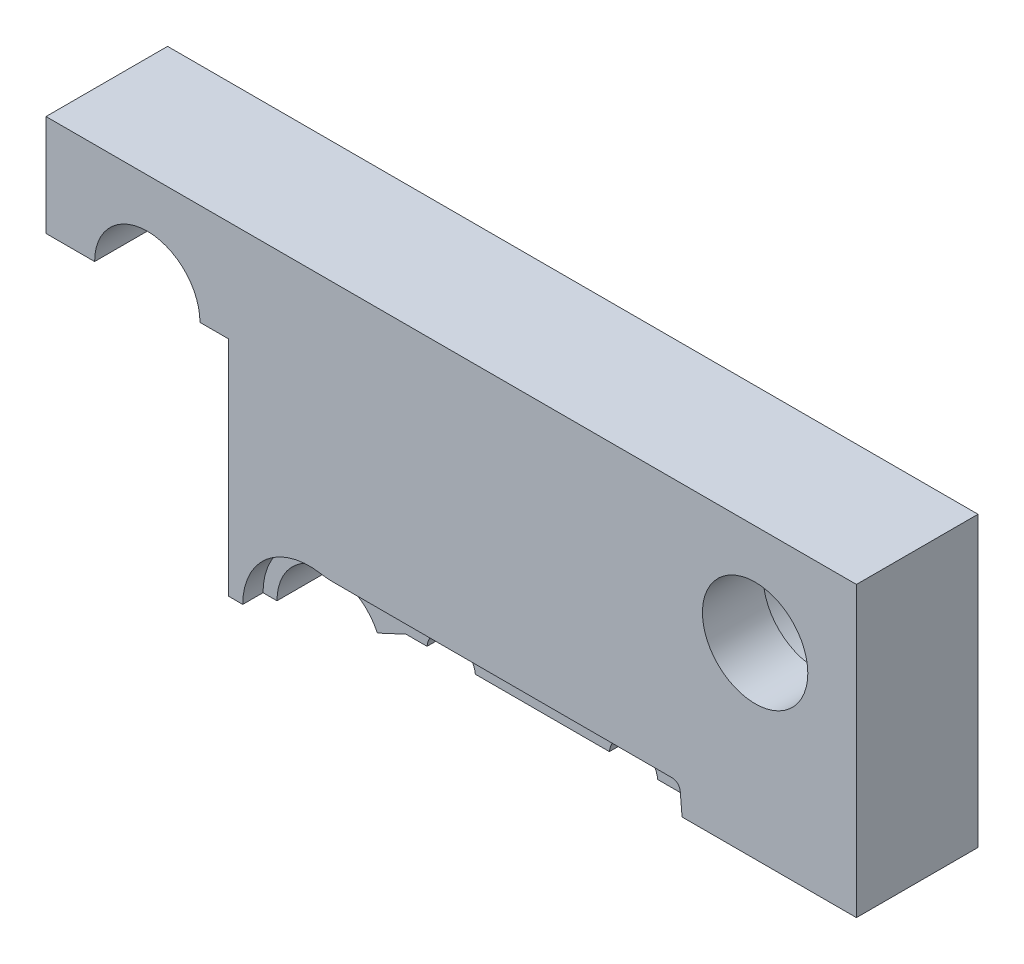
ISO-10303-21;
HEADER;
FILE_DESCRIPTION(('STEP AP214'),'2;1');
FILE_NAME('part.step','',(''),(''),'','','');
FILE_SCHEMA(('AUTOMOTIVE_DESIGN { 1 0 10303 214 1 1 1 1 }'));
ENDSEC;
DATA;
#1=APPLICATION_CONTEXT('core data for automotive mechanical design processes');
#2=APPLICATION_PROTOCOL_DEFINITION('international standard','automotive_design',2000,#1);
#3=PRODUCT_CONTEXT('',#1,'mechanical');
#4=PRODUCT('Part','Part','',(#3));
#5=PRODUCT_RELATED_PRODUCT_CATEGORY('part','',(#4));
#6=PRODUCT_DEFINITION_FORMATION('','',#4);
#7=PRODUCT_DEFINITION_CONTEXT('part definition',#1,'design');
#8=PRODUCT_DEFINITION('design','',#6,#7);
#9=PRODUCT_DEFINITION_SHAPE('','',#8);
#10=(LENGTH_UNIT() NAMED_UNIT(*) SI_UNIT(.MILLI.,.METRE.));
#11=(NAMED_UNIT(*) PLANE_ANGLE_UNIT() SI_UNIT($,.RADIAN.));
#12=(NAMED_UNIT(*) SI_UNIT($,.STERADIAN.) SOLID_ANGLE_UNIT());
#13=UNCERTAINTY_MEASURE_WITH_UNIT(LENGTH_MEASURE(1.E-05),#10,'distance_accuracy_value','');
#14=(GEOMETRIC_REPRESENTATION_CONTEXT(3) GLOBAL_UNCERTAINTY_ASSIGNED_CONTEXT((#13)) GLOBAL_UNIT_ASSIGNED_CONTEXT((#10,
#11,#12)) REPRESENTATION_CONTEXT('',''));
#15=CARTESIAN_POINT('',(0.,0.,0.));
#16=DIRECTION('',(0.,0.,1.));
#17=DIRECTION('',(1.,0.,0.));
#18=AXIS2_PLACEMENT_3D('',#15,#16,#17);
#19=CARTESIAN_POINT('',(0.,0.,30.));
#20=DIRECTION('',(1.,0.,0.));
#21=DIRECTION('',(0.,0.,-1.));
#22=AXIS2_PLACEMENT_3D('',#19,#20,#21);
#23=PLANE('',#22);
#24=DIRECTION('',(0.,-1.,0.));
#25=VECTOR('',#24,1.);
#26=CARTESIAN_POINT('',(0.,0.,0.));
#27=LINE('',#26,#25);
#28=CARTESIAN_POINT('',(0.,150.,0.));
#29=VERTEX_POINT('',#28);
#30=CARTESIAN_POINT('',(0.,125.,0.));
#31=VERTEX_POINT('',#30);
#32=EDGE_CURVE('E298',#29,#31,#27,.T.);
#33=ORIENTED_EDGE('',*,*,#32,.T.);
#34=DIRECTION('',(0.,0.,1.));
#35=VECTOR('',#34,1.);
#36=CARTESIAN_POINT('',(0.,125.,30.));
#37=LINE('',#36,#35);
#38=CARTESIAN_POINT('',(0.,125.,30.));
#39=VERTEX_POINT('',#38);
#40=EDGE_CURVE('E334',#31,#39,#37,.T.);
#41=ORIENTED_EDGE('',*,*,#40,.T.);
#42=DIRECTION('',(0.,-1.,0.));
#43=VECTOR('',#42,1.);
#44=CARTESIAN_POINT('',(0.,0.,30.));
#45=LINE('',#44,#43);
#46=CARTESIAN_POINT('',(0.,150.,30.));
#47=VERTEX_POINT('',#46);
#48=EDGE_CURVE('E312',#47,#39,#45,.T.);
#49=ORIENTED_EDGE('',*,*,#48,.F.);
#50=DIRECTION('',(0.,0.,-1.));
#51=VECTOR('',#50,1.);
#52=CARTESIAN_POINT('',(0.,150.,30.));
#53=LINE('',#52,#51);
#54=EDGE_CURVE('E234',#47,#29,#53,.T.);
#55=ORIENTED_EDGE('',*,*,#54,.T.);
#56=EDGE_LOOP('',(#33,#41,#49,#55));
#57=FACE_BOUND('',#56,.T.);
#58=ADVANCED_FACE('F28',(#57),#23,.F.);
#59=CARTESIAN_POINT('',(200.,0.,30.));
#60=DIRECTION('',(-1.,0.,0.));
#61=DIRECTION('',(0.,0.,1.));
#62=AXIS2_PLACEMENT_3D('',#59,#60,#61);
#63=PLANE('',#62);
#64=DIRECTION('',(0.,1.,0.));
#65=VECTOR('',#64,1.);
#66=CARTESIAN_POINT('',(200.,0.,30.));
#67=LINE('',#66,#65);
#68=CARTESIAN_POINT('',(200.,78.7816772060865,30.));
#69=VERTEX_POINT('',#68);
#70=CARTESIAN_POINT('',(200.,150.,30.));
#71=VERTEX_POINT('',#70);
#72=EDGE_CURVE('E315',#69,#71,#67,.T.);
#73=ORIENTED_EDGE('',*,*,#72,.F.);
#74=DIRECTION('',(0.,0.,-1.));
#75=VECTOR('',#74,1.);
#76=CARTESIAN_POINT('',(200.,78.7816772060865,30.));
#77=LINE('',#76,#75);
#78=CARTESIAN_POINT('',(200.,78.7816772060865,0.));
#79=VERTEX_POINT('',#78);
#80=EDGE_CURVE('E386',#69,#79,#77,.T.);
#81=ORIENTED_EDGE('',*,*,#80,.T.);
#82=DIRECTION('',(0.,1.,0.));
#83=VECTOR('',#82,1.);
#84=CARTESIAN_POINT('',(200.,0.,0.));
#85=LINE('',#84,#83);
#86=CARTESIAN_POINT('',(200.,150.,0.));
#87=VERTEX_POINT('',#86);
#88=EDGE_CURVE('E308',#79,#87,#85,.T.);
#89=ORIENTED_EDGE('',*,*,#88,.T.);
#90=DIRECTION('',(0.,0.,-1.));
#91=VECTOR('',#90,1.);
#92=CARTESIAN_POINT('',(200.,150.,30.));
#93=LINE('',#92,#91);
#94=EDGE_CURVE('E229',#71,#87,#93,.T.);
#95=ORIENTED_EDGE('',*,*,#94,.F.);
#96=EDGE_LOOP('',(#73,#81,#89,#95));
#97=FACE_BOUND('',#96,.T.);
#98=ADVANCED_FACE('F499',(#97),#63,.F.);
#99=CARTESIAN_POINT('',(0.,150.,30.));
#100=DIRECTION('',(0.,-1.,0.));
#101=DIRECTION('',(0.,0.,-1.));
#102=AXIS2_PLACEMENT_3D('',#99,#100,#101);
#103=PLANE('',#102);
#104=DIRECTION('',(-1.,0.,0.));
#105=VECTOR('',#104,1.);
#106=CARTESIAN_POINT('',(0.,150.,0.));
#107=LINE('',#106,#105);
#108=EDGE_CURVE('E310',#87,#29,#107,.T.);
#109=ORIENTED_EDGE('',*,*,#108,.T.);
#110=ORIENTED_EDGE('',*,*,#54,.F.);
#111=DIRECTION('',(-1.,0.,0.));
#112=VECTOR('',#111,1.);
#113=CARTESIAN_POINT('',(0.,150.,30.));
#114=LINE('',#113,#112);
#115=EDGE_CURVE('E317',#71,#47,#114,.T.);
#116=ORIENTED_EDGE('',*,*,#115,.F.);
#117=ORIENTED_EDGE('',*,*,#94,.T.);
#118=EDGE_LOOP('',(#109,#110,#116,#117));
#119=FACE_BOUND('',#118,.T.);
#120=ADVANCED_FACE('F503',(#119),#103,.F.);
#121=CARTESIAN_POINT('',(0.,150.,30.));
#122=DIRECTION('',(0.,0.,-1.));
#123=DIRECTION('',(-1.,0.,0.));
#124=AXIS2_PLACEMENT_3D('',#121,#122,#123);
#125=PLANE('',#124);
#126=CARTESIAN_POINT('',(175.,125.,30.));
#127=DIRECTION('',(0.,0.,1.));
#128=DIRECTION('',(1.,0.,0.));
#129=AXIS2_PLACEMENT_3D('',#126,#127,#128);
#130=CIRCLE('',#129,13.);
#131=CARTESIAN_POINT('',(188.,125.,30.));
#132=VERTEX_POINT('',#131);
#133=EDGE_CURVE('E410',#132,#132,#130,.T.);
#134=ORIENTED_EDGE('',*,*,#133,.F.);
#135=EDGE_LOOP('',(#134));
#136=FACE_BOUND('',#135,.T.);
#137=ORIENTED_EDGE('',*,*,#48,.T.);
#138=DIRECTION('',(1.,0.,0.));
#139=VECTOR('',#138,1.);
#140=CARTESIAN_POINT('',(0.,125.,30.));
#141=LINE('',#140,#139);
#142=CARTESIAN_POINT('',(12.,125.,30.));
#143=VERTEX_POINT('',#142);
#144=EDGE_CURVE('E330',#39,#143,#141,.T.);
#145=ORIENTED_EDGE('',*,*,#144,.T.);
#146=CARTESIAN_POINT('',(25.,125.,30.));
#147=DIRECTION('',(0.,0.,1.));
#148=DIRECTION('',(1.,0.,0.));
#149=AXIS2_PLACEMENT_3D('',#146,#147,#148);
#150=CIRCLE('',#149,13.);
#151=CARTESIAN_POINT('',(38.,125.,30.));
#152=VERTEX_POINT('',#151);
#153=EDGE_CURVE('E413',#152,#143,#150,.T.);
#154=ORIENTED_EDGE('',*,*,#153,.F.);
#155=CARTESIAN_POINT('',(45.,125.,30.));
#156=VERTEX_POINT('',#155);
#157=EDGE_CURVE('E42',#152,#156,#141,.T.);
#158=ORIENTED_EDGE('',*,*,#157,.T.);
#159=DIRECTION('',(0.,-1.,0.));
#160=VECTOR('',#159,1.);
#161=CARTESIAN_POINT('',(45.,150.,30.));
#162=LINE('',#161,#160);
#163=CARTESIAN_POINT('',(45.,70.,30.));
#164=VERTEX_POINT('',#163);
#165=EDGE_CURVE('E46',#156,#164,#162,.T.);
#166=ORIENTED_EDGE('',*,*,#165,.T.);
#167=DIRECTION('',(1.,0.,0.));
#168=VECTOR('',#167,1.);
#169=CARTESIAN_POINT('',(0.,70.,30.));
#170=LINE('',#169,#168);
#171=CARTESIAN_POINT('',(48.555,70.,30.));
#172=VERTEX_POINT('',#171);
#173=EDGE_CURVE('E396',#164,#172,#170,.T.);
#174=ORIENTED_EDGE('',*,*,#173,.T.);
#175=CARTESIAN_POINT('',(65.,70.,30.));
#176=DIRECTION('',(0.,0.,1.));
#177=DIRECTION('',(1.,0.,0.));
#178=AXIS2_PLACEMENT_3D('',#175,#176,#177);
#179=CIRCLE('',#178,16.445);
#180=CARTESIAN_POINT('',(67.7403932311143,86.2150630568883,30.));
#181=VERTEX_POINT('',#180);
#182=EDGE_CURVE('E271',#181,#172,#179,.T.);
#183=ORIENTED_EDGE('',*,*,#182,.F.);
#184=CARTESIAN_POINT('',(71.0781905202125,105.965,30.));
#185=DIRECTION('',(0.,0.,-1.));
#186=DIRECTION('',(-1.,0.,0.));
#187=AXIS2_PLACEMENT_3D('',#184,#185,#186);
#188=CIRCLE('',#187,20.03);
#189=CARTESIAN_POINT('',(71.0781905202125,85.935,30.));
#190=VERTEX_POINT('',#189);
#191=EDGE_CURVE('E263',#190,#181,#188,.T.);
#192=ORIENTED_EDGE('',*,*,#191,.F.);
#193=DIRECTION('',(-1.,0.,0.));
#194=VECTOR('',#193,1.);
#195=CARTESIAN_POINT('',(71.0781905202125,85.935,30.));
#196=LINE('',#195,#194);
#197=CARTESIAN_POINT('',(154.489847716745,85.935,30.));
#198=VERTEX_POINT('',#197);
#199=EDGE_CURVE('E279',#198,#190,#196,.T.);
#200=ORIENTED_EDGE('',*,*,#199,.F.);
#201=CARTESIAN_POINT('',(154.489847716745,83.905,30.));
#202=DIRECTION('',(0.,0.,1.));
#203=DIRECTION('',(-1.,0.,0.));
#204=AXIS2_PLACEMENT_3D('',#201,#202,#203);
#205=CIRCLE('',#204,2.03000000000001);
#206=CARTESIAN_POINT('',(156.512122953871,84.0819261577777,30.));
#207=VERTEX_POINT('',#206);
#208=EDGE_CURVE('E276',#207,#198,#205,.T.);
#209=ORIENTED_EDGE('',*,*,#208,.F.);
#210=DIRECTION('',(-0.0871557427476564,0.996194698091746,0.));
#211=VECTOR('',#210,1.);
#212=CARTESIAN_POINT('',(156.512122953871,84.0819261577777,30.));
#213=LINE('',#212,#211);
#214=CARTESIAN_POINT('',(156.975834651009,78.7816772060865,30.));
#215=VERTEX_POINT('',#214);
#216=EDGE_CURVE('E274',#215,#207,#213,.T.);
#217=ORIENTED_EDGE('',*,*,#216,.F.);
#218=DIRECTION('',(1.,0.,0.));
#219=VECTOR('',#218,1.);
#220=CARTESIAN_POINT('',(0.,78.7816772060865,30.));
#221=LINE('',#220,#219);
#222=EDGE_CURVE('E383',#215,#69,#221,.T.);
#223=ORIENTED_EDGE('',*,*,#222,.T.);
#224=ORIENTED_EDGE('',*,*,#72,.T.);
#225=ORIENTED_EDGE('',*,*,#115,.T.);
#226=EDGE_LOOP('',(#137,#145,#154,#158,#166,#174,#183,#192,#200,#209,#217,#223,#224,#225));
#227=FACE_BOUND('',#226,.T.);
#228=ADVANCED_FACE('F508',(#136,#227),#125,.F.);
#229=CARTESIAN_POINT('',(0.,150.,0.));
#230=DIRECTION('',(0.,0.,-1.));
#231=DIRECTION('',(-1.,0.,0.));
#232=AXIS2_PLACEMENT_3D('',#229,#230,#231);
#233=PLANE('',#232);
#234=DIRECTION('',(1.,0.,0.));
#235=VECTOR('',#234,1.);
#236=CARTESIAN_POINT('',(0.,125.,0.));
#237=LINE('',#236,#235);
#238=CARTESIAN_POINT('',(4.99999999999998,125.,0.));
#239=VERTEX_POINT('',#238);
#240=EDGE_CURVE('E328',#31,#239,#237,.T.);
#241=ORIENTED_EDGE('',*,*,#240,.F.);
#242=ORIENTED_EDGE('',*,*,#32,.F.);
#243=ORIENTED_EDGE('',*,*,#108,.F.);
#244=ORIENTED_EDGE('',*,*,#88,.F.);
#245=DIRECTION('',(1.,0.,0.));
#246=VECTOR('',#245,1.);
#247=CARTESIAN_POINT('',(0.,78.7816772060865,0.));
#248=LINE('',#247,#246);
#249=CARTESIAN_POINT('',(148.975643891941,78.7816772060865,0.));
#250=VERTEX_POINT('',#249);
#251=EDGE_CURVE('E360',#250,#79,#248,.T.);
#252=ORIENTED_EDGE('',*,*,#251,.F.);
#253=CARTESIAN_POINT('',(140.,78.12,0.));
#254=DIRECTION('',(0.,0.,1.));
#255=DIRECTION('',(1.,0.,0.));
#256=AXIS2_PLACEMENT_3D('',#253,#254,#255);
#257=CIRCLE('',#256,9.00000000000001);
#258=CARTESIAN_POINT('',(131.024356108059,78.7816772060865,0.));
#259=VERTEX_POINT('',#258);
#260=EDGE_CURVE('E428',#250,#259,#257,.T.);
#261=ORIENTED_EDGE('',*,*,#260,.T.);
#262=CARTESIAN_POINT('',(103.975643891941,78.7816772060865,0.));
#263=VERTEX_POINT('',#262);
#264=EDGE_CURVE('E355',#263,#259,#248,.T.);
#265=ORIENTED_EDGE('',*,*,#264,.F.);
#266=CARTESIAN_POINT('',(95.,78.12,0.));
#267=DIRECTION('',(0.,0.,1.));
#268=DIRECTION('',(1.,0.,0.));
#269=AXIS2_PLACEMENT_3D('',#266,#267,#268);
#270=CIRCLE('',#269,8.99999999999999);
#271=CARTESIAN_POINT('',(86.0243561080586,78.7816772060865,0.));
#272=VERTEX_POINT('',#271);
#273=EDGE_CURVE('E419',#263,#272,#270,.T.);
#274=ORIENTED_EDGE('',*,*,#273,.T.);
#275=CARTESIAN_POINT('',(83.8323675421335,78.7816772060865,0.));
#276=VERTEX_POINT('',#275);
#277=EDGE_CURVE('E361',#276,#272,#248,.T.);
#278=ORIENTED_EDGE('',*,*,#277,.F.);
#279=DIRECTION('',(0.906307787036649,0.422618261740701,0.));
#280=VECTOR('',#279,1.);
#281=CARTESIAN_POINT('',(42.2511804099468,59.3920512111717,0.));
#282=LINE('',#281,#280);
#283=CARTESIAN_POINT('',(76.7820012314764,75.4940374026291,0.));
#284=VERTEX_POINT('',#283);
#285=EDGE_CURVE('E390',#284,#276,#282,.T.);
#286=ORIENTED_EDGE('',*,*,#285,.F.);
#287=CARTESIAN_POINT('',(65.,70.,0.));
#288=DIRECTION('',(0.,0.,1.));
#289=DIRECTION('',(1.,0.,0.));
#290=AXIS2_PLACEMENT_3D('',#287,#288,#289);
#291=CIRCLE('',#290,13.);
#292=CARTESIAN_POINT('',(52.,70.,0.));
#293=VERTEX_POINT('',#292);
#294=EDGE_CURVE('E250',#284,#293,#291,.T.);
#295=ORIENTED_EDGE('',*,*,#294,.T.);
#296=DIRECTION('',(1.,0.,0.));
#297=VECTOR('',#296,1.);
#298=CARTESIAN_POINT('',(0.,70.,0.));
#299=LINE('',#298,#297);
#300=CARTESIAN_POINT('',(45.,70.,0.));
#301=VERTEX_POINT('',#300);
#302=EDGE_CURVE('E220',#301,#293,#299,.T.);
#303=ORIENTED_EDGE('',*,*,#302,.F.);
#304=DIRECTION('',(0.,-1.,0.));
#305=VECTOR('',#304,1.);
#306=CARTESIAN_POINT('',(45.,150.,0.));
#307=LINE('',#306,#305);
#308=CARTESIAN_POINT('',(45.,125.,0.));
#309=VERTEX_POINT('',#308);
#310=EDGE_CURVE('E215',#309,#301,#307,.T.);
#311=ORIENTED_EDGE('',*,*,#310,.F.);
#312=CARTESIAN_POINT('',(25.,125.,0.));
#313=DIRECTION('',(0.,0.,1.));
#314=DIRECTION('',(1.,0.,0.));
#315=AXIS2_PLACEMENT_3D('',#312,#313,#314);
#316=CIRCLE('',#315,20.);
#317=EDGE_CURVE('E201',#309,#239,#316,.T.);
#318=ORIENTED_EDGE('',*,*,#317,.T.);
#319=EDGE_LOOP('',(#241,#242,#243,#244,#252,#261,#265,#274,#278,#286,#295,#303,#311,#318));
#320=FACE_BOUND('',#319,.T.);
#321=CARTESIAN_POINT('',(175.,125.,0.));
#322=DIRECTION('',(0.,0.,1.));
#323=DIRECTION('',(1.,0.,0.));
#324=AXIS2_PLACEMENT_3D('',#321,#322,#323);
#325=CIRCLE('',#324,20.);
#326=CARTESIAN_POINT('',(195.,125.,0.));
#327=VERTEX_POINT('',#326);
#328=EDGE_CURVE('E401',#327,#327,#325,.T.);
#329=ORIENTED_EDGE('',*,*,#328,.T.);
#330=EDGE_LOOP('',(#329));
#331=FACE_BOUND('',#330,.T.);
#332=ADVANCED_FACE('F216',(#320,#331),#233,.T.);
#333=CARTESIAN_POINT('',(71.0781905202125,105.965,25.));
#334=DIRECTION('',(0.,0.,1.));
#335=DIRECTION('',(1.,0.,0.));
#336=AXIS2_PLACEMENT_3D('',#333,#334,#335);
#337=CYLINDRICAL_SURFACE('',#336,20.03);
#338=ORIENTED_EDGE('',*,*,#191,.T.);
#339=DIRECTION('',(0.,0.,1.));
#340=VECTOR('',#339,1.);
#341=CARTESIAN_POINT('',(67.7403932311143,86.2150630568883,25.));
#342=LINE('',#341,#340);
#343=CARTESIAN_POINT('',(67.7403932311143,86.2150630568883,25.));
#344=VERTEX_POINT('',#343);
#345=EDGE_CURVE('E295',#344,#181,#342,.T.);
#346=ORIENTED_EDGE('',*,*,#345,.F.);
#347=CARTESIAN_POINT('',(71.0781905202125,105.965,25.));
#348=DIRECTION('',(0.,0.,-1.));
#349=DIRECTION('',(-1.,0.,0.));
#350=AXIS2_PLACEMENT_3D('',#347,#348,#349);
#351=CIRCLE('',#350,20.03);
#352=CARTESIAN_POINT('',(71.0781905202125,85.935,25.));
#353=VERTEX_POINT('',#352);
#354=EDGE_CURVE('E282',#353,#344,#351,.T.);
#355=ORIENTED_EDGE('',*,*,#354,.F.);
#356=DIRECTION('',(0.,0.,1.));
#357=VECTOR('',#356,1.);
#358=CARTESIAN_POINT('',(71.0781905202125,85.935,25.));
#359=LINE('',#358,#357);
#360=EDGE_CURVE('E296',#353,#190,#359,.T.);
#361=ORIENTED_EDGE('',*,*,#360,.T.);
#362=EDGE_LOOP('',(#338,#346,#355,#361));
#363=FACE_BOUND('',#362,.T.);
#364=ADVANCED_FACE('F460',(#363),#337,.T.);
#365=CARTESIAN_POINT('',(71.0781905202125,85.935,25.));
#366=DIRECTION('',(0.,1.,0.));
#367=DIRECTION('',(0.,0.,1.));
#368=AXIS2_PLACEMENT_3D('',#365,#366,#367);
#369=PLANE('',#368);
#370=ORIENTED_EDGE('',*,*,#199,.T.);
#371=ORIENTED_EDGE('',*,*,#360,.F.);
#372=DIRECTION('',(-1.,0.,0.));
#373=VECTOR('',#372,1.);
#374=CARTESIAN_POINT('',(71.0781905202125,85.935,25.));
#375=LINE('',#374,#373);
#376=CARTESIAN_POINT('',(154.489847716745,85.935,25.));
#377=VERTEX_POINT('',#376);
#378=EDGE_CURVE('E292',#377,#353,#375,.T.);
#379=ORIENTED_EDGE('',*,*,#378,.F.);
#380=DIRECTION('',(0.,0.,1.));
#381=VECTOR('',#380,1.);
#382=CARTESIAN_POINT('',(154.489847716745,85.935,25.));
#383=LINE('',#382,#381);
#384=EDGE_CURVE('E299',#377,#198,#383,.T.);
#385=ORIENTED_EDGE('',*,*,#384,.T.);
#386=EDGE_LOOP('',(#370,#371,#379,#385));
#387=FACE_BOUND('',#386,.T.);
#388=ADVANCED_FACE('F455',(#387),#369,.F.);
#389=CARTESIAN_POINT('',(154.489847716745,83.905,25.));
#390=DIRECTION('',(0.,0.,1.));
#391=DIRECTION('',(1.,0.,0.));
#392=AXIS2_PLACEMENT_3D('',#389,#390,#391);
#393=CYLINDRICAL_SURFACE('',#392,2.03000000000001);
#394=ORIENTED_EDGE('',*,*,#208,.T.);
#395=ORIENTED_EDGE('',*,*,#384,.F.);
#396=CARTESIAN_POINT('',(154.489847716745,83.905,25.));
#397=DIRECTION('',(0.,0.,1.));
#398=DIRECTION('',(-1.,0.,0.));
#399=AXIS2_PLACEMENT_3D('',#396,#397,#398);
#400=CIRCLE('',#399,2.03000000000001);
#401=CARTESIAN_POINT('',(156.512122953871,84.0819261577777,25.));
#402=VERTEX_POINT('',#401);
#403=EDGE_CURVE('E289',#402,#377,#400,.T.);
#404=ORIENTED_EDGE('',*,*,#403,.F.);
#405=DIRECTION('',(0.,0.,1.));
#406=VECTOR('',#405,1.);
#407=CARTESIAN_POINT('',(156.512122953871,84.0819261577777,25.));
#408=LINE('',#407,#406);
#409=EDGE_CURVE('E301',#402,#207,#408,.T.);
#410=ORIENTED_EDGE('',*,*,#409,.T.);
#411=EDGE_LOOP('',(#394,#395,#404,#410));
#412=FACE_BOUND('',#411,.T.);
#413=ADVANCED_FACE('F452',(#412),#393,.F.);
#414=CARTESIAN_POINT('',(156.512122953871,84.0819261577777,25.));
#415=DIRECTION('',(0.996194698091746,0.0871557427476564,0.));
#416=DIRECTION('',(-0.0871557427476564,0.996194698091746,0.));
#417=AXIS2_PLACEMENT_3D('',#414,#415,#416);
#418=PLANE('',#417);
#419=DIRECTION('',(-0.0871557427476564,0.996194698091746,0.));
#420=VECTOR('',#419,1.);
#421=CARTESIAN_POINT('',(156.512122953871,84.0819261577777,25.));
#422=LINE('',#421,#420);
#423=CARTESIAN_POINT('',(156.975834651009,78.7816772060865,25.));
#424=VERTEX_POINT('',#423);
#425=EDGE_CURVE('E287',#424,#402,#422,.T.);
#426=ORIENTED_EDGE('',*,*,#425,.F.);
#427=DIRECTION('',(0.,0.,1.));
#428=VECTOR('',#427,1.);
#429=CARTESIAN_POINT('',(156.975834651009,78.7816772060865,25.));
#430=LINE('',#429,#428);
#431=EDGE_CURVE('E380',#424,#215,#430,.T.);
#432=ORIENTED_EDGE('',*,*,#431,.T.);
#433=ORIENTED_EDGE('',*,*,#216,.T.);
#434=ORIENTED_EDGE('',*,*,#409,.F.);
#435=EDGE_LOOP('',(#426,#432,#433,#434));
#436=FACE_BOUND('',#435,.T.);
#437=ADVANCED_FACE('F447',(#436),#418,.F.);
#438=CARTESIAN_POINT('',(65.,70.,25.));
#439=DIRECTION('',(0.,0.,1.));
#440=DIRECTION('',(1.,0.,0.));
#441=AXIS2_PLACEMENT_3D('',#438,#439,#440);
#442=CYLINDRICAL_SURFACE('',#441,16.445);
#443=ORIENTED_EDGE('',*,*,#182,.T.);
#444=DIRECTION('',(0.,0.,1.));
#445=VECTOR('',#444,1.);
#446=CARTESIAN_POINT('',(48.555,70.,25.));
#447=LINE('',#446,#445);
#448=CARTESIAN_POINT('',(48.555,70.,25.));
#449=VERTEX_POINT('',#448);
#450=EDGE_CURVE('E393',#172,#449,#447,.F.);
#451=ORIENTED_EDGE('',*,*,#450,.T.);
#452=CARTESIAN_POINT('',(65.,70.,25.));
#453=DIRECTION('',(0.,0.,1.));
#454=DIRECTION('',(1.,0.,0.));
#455=AXIS2_PLACEMENT_3D('',#452,#453,#454);
#456=CIRCLE('',#455,16.445);
#457=EDGE_CURVE('E285',#344,#449,#456,.T.);
#458=ORIENTED_EDGE('',*,*,#457,.F.);
#459=ORIENTED_EDGE('',*,*,#345,.T.);
#460=EDGE_LOOP('',(#443,#451,#458,#459));
#461=FACE_BOUND('',#460,.T.);
#462=ADVANCED_FACE('F519',(#461),#442,.F.);
#463=CARTESIAN_POINT('',(71.0781905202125,105.965,25.));
#464=DIRECTION('',(0.,0.,-1.));
#465=DIRECTION('',(-1.,0.,0.));
#466=AXIS2_PLACEMENT_3D('',#463,#464,#465);
#467=PLANE('',#466);
#468=ORIENTED_EDGE('',*,*,#457,.T.);
#469=DIRECTION('',(1.,0.,0.));
#470=VECTOR('',#469,1.);
#471=CARTESIAN_POINT('',(71.0781905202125,70.,25.));
#472=LINE('',#471,#470);
#473=CARTESIAN_POINT('',(52.,70.,25.));
#474=VERTEX_POINT('',#473);
#475=EDGE_CURVE('E260',#449,#474,#472,.T.);
#476=ORIENTED_EDGE('',*,*,#475,.T.);
#477=CARTESIAN_POINT('',(65.,70.,25.));
#478=DIRECTION('',(0.,0.,1.));
#479=DIRECTION('',(1.,0.,0.));
#480=AXIS2_PLACEMENT_3D('',#477,#478,#479);
#481=CIRCLE('',#480,13.);
#482=CARTESIAN_POINT('',(76.7820012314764,75.4940374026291,25.));
#483=VERTEX_POINT('',#482);
#484=EDGE_CURVE('E248',#483,#474,#481,.T.);
#485=ORIENTED_EDGE('',*,*,#484,.F.);
#486=DIRECTION('',(0.906307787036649,0.422618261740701,0.));
#487=VECTOR('',#486,1.);
#488=CARTESIAN_POINT('',(83.7679822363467,78.7516538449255,25.));
#489=LINE('',#488,#487);
#490=CARTESIAN_POINT('',(83.8323675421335,78.7816772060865,25.));
#491=VERTEX_POINT('',#490);
#492=EDGE_CURVE('E258',#483,#491,#489,.T.);
#493=ORIENTED_EDGE('',*,*,#492,.T.);
#494=DIRECTION('',(1.,0.,0.));
#495=VECTOR('',#494,1.);
#496=CARTESIAN_POINT('',(71.0781905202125,78.7816772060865,25.));
#497=LINE('',#496,#495);
#498=CARTESIAN_POINT('',(89.0365963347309,78.7816772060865,25.));
#499=VERTEX_POINT('',#498);
#500=EDGE_CURVE('E357',#491,#499,#497,.T.);
#501=ORIENTED_EDGE('',*,*,#500,.T.);
#502=CARTESIAN_POINT('',(95.,78.12,25.));
#503=DIRECTION('',(0.,0.,1.));
#504=DIRECTION('',(1.,0.,0.));
#505=AXIS2_PLACEMENT_3D('',#502,#503,#504);
#506=CIRCLE('',#505,6.);
#507=CARTESIAN_POINT('',(100.963403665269,78.7816772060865,25.));
#508=VERTEX_POINT('',#507);
#509=EDGE_CURVE('E266',#508,#499,#506,.T.);
#510=ORIENTED_EDGE('',*,*,#509,.F.);
#511=CARTESIAN_POINT('',(134.036596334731,78.7816772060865,25.));
#512=VERTEX_POINT('',#511);
#513=EDGE_CURVE('E352',#508,#512,#497,.T.);
#514=ORIENTED_EDGE('',*,*,#513,.T.);
#515=CARTESIAN_POINT('',(140.,78.12,25.));
#516=DIRECTION('',(0.,0.,1.));
#517=DIRECTION('',(1.,0.,0.));
#518=AXIS2_PLACEMENT_3D('',#515,#516,#517);
#519=CIRCLE('',#518,6.00000000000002);
#520=CARTESIAN_POINT('',(145.963403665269,78.7816772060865,25.));
#521=VERTEX_POINT('',#520);
#522=EDGE_CURVE('E261',#521,#512,#519,.T.);
#523=ORIENTED_EDGE('',*,*,#522,.F.);
#524=EDGE_CURVE('E356',#521,#424,#497,.T.);
#525=ORIENTED_EDGE('',*,*,#524,.T.);
#526=ORIENTED_EDGE('',*,*,#425,.T.);
#527=ORIENTED_EDGE('',*,*,#403,.T.);
#528=ORIENTED_EDGE('',*,*,#378,.T.);
#529=ORIENTED_EDGE('',*,*,#354,.T.);
#530=EDGE_LOOP('',(#468,#476,#485,#493,#501,#510,#514,#523,#525,#526,#527,#528,#529));
#531=FACE_BOUND('',#530,.T.);
#532=ADVANCED_FACE('F256',(#531),#467,.F.);
#533=CARTESIAN_POINT('',(65.,70.,0.));
#534=DIRECTION('',(0.,0.,1.));
#535=DIRECTION('',(1.,0.,0.));
#536=AXIS2_PLACEMENT_3D('',#533,#534,#535);
#537=CYLINDRICAL_SURFACE('',#536,13.);
#538=ORIENTED_EDGE('',*,*,#484,.T.);
#539=DIRECTION('',(0.,0.,1.));
#540=VECTOR('',#539,1.);
#541=CARTESIAN_POINT('',(52.,70.,0.));
#542=LINE('',#541,#540);
#543=EDGE_CURVE('E11',#474,#293,#542,.F.);
#544=ORIENTED_EDGE('',*,*,#543,.T.);
#545=ORIENTED_EDGE('',*,*,#294,.F.);
#546=DIRECTION('',(0.,0.,1.));
#547=VECTOR('',#546,1.);
#548=CARTESIAN_POINT('',(76.7820012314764,75.4940374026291,0.));
#549=LINE('',#548,#547);
#550=EDGE_CURVE('E35',#284,#483,#549,.T.);
#551=ORIENTED_EDGE('',*,*,#550,.T.);
#552=EDGE_LOOP('',(#538,#544,#545,#551));
#553=FACE_BOUND('',#552,.T.);
#554=ADVANCED_FACE('F247',(#553),#537,.F.);
#555=CARTESIAN_POINT('',(140.,78.12,12.));
#556=DIRECTION('',(0.,0.,1.));
#557=DIRECTION('',(1.,0.,0.));
#558=AXIS2_PLACEMENT_3D('',#555,#556,#557);
#559=CYLINDRICAL_SURFACE('',#558,6.00000000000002);
#560=ORIENTED_EDGE('',*,*,#522,.T.);
#561=DIRECTION('',(0.,0.,1.));
#562=VECTOR('',#561,1.);
#563=CARTESIAN_POINT('',(134.036596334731,78.7816772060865,12.));
#564=LINE('',#563,#562);
#565=CARTESIAN_POINT('',(134.036596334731,78.7816772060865,12.));
#566=VERTEX_POINT('',#565);
#567=EDGE_CURVE('E367',#512,#566,#564,.F.);
#568=ORIENTED_EDGE('',*,*,#567,.T.);
#569=CARTESIAN_POINT('',(140.,78.12,12.));
#570=DIRECTION('',(0.,0.,1.));
#571=DIRECTION('',(1.,0.,0.));
#572=AXIS2_PLACEMENT_3D('',#569,#570,#571);
#573=CIRCLE('',#572,6.00000000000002);
#574=CARTESIAN_POINT('',(145.963403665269,78.7816772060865,12.));
#575=VERTEX_POINT('',#574);
#576=EDGE_CURVE('E431',#566,#575,#573,.F.);
#577=ORIENTED_EDGE('',*,*,#576,.T.);
#578=DIRECTION('',(0.,0.,1.));
#579=VECTOR('',#578,1.);
#580=CARTESIAN_POINT('',(145.963403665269,78.7816772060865,12.));
#581=LINE('',#580,#579);
#582=EDGE_CURVE('E377',#575,#521,#581,.T.);
#583=ORIENTED_EDGE('',*,*,#582,.T.);
#584=EDGE_LOOP('',(#560,#568,#577,#583));
#585=FACE_BOUND('',#584,.T.);
#586=ADVANCED_FACE('F532',(#585),#559,.F.);
#587=CARTESIAN_POINT('',(95.,78.12,12.));
#588=DIRECTION('',(0.,0.,1.));
#589=DIRECTION('',(1.,0.,0.));
#590=AXIS2_PLACEMENT_3D('',#587,#588,#589);
#591=CYLINDRICAL_SURFACE('',#590,6.);
#592=ORIENTED_EDGE('',*,*,#509,.T.);
#593=DIRECTION('',(0.,0.,1.));
#594=VECTOR('',#593,1.);
#595=CARTESIAN_POINT('',(89.0365963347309,78.7816772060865,12.));
#596=LINE('',#595,#594);
#597=CARTESIAN_POINT('',(89.0365963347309,78.7816772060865,12.));
#598=VERTEX_POINT('',#597);
#599=EDGE_CURVE('E371',#499,#598,#596,.F.);
#600=ORIENTED_EDGE('',*,*,#599,.T.);
#601=CARTESIAN_POINT('',(95.,78.12,12.));
#602=DIRECTION('',(0.,0.,1.));
#603=DIRECTION('',(1.,0.,0.));
#604=AXIS2_PLACEMENT_3D('',#601,#602,#603);
#605=CIRCLE('',#604,6.);
#606=CARTESIAN_POINT('',(100.963403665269,78.7816772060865,12.));
#607=VERTEX_POINT('',#606);
#608=EDGE_CURVE('E422',#598,#607,#605,.F.);
#609=ORIENTED_EDGE('',*,*,#608,.T.);
#610=DIRECTION('',(0.,0.,1.));
#611=VECTOR('',#610,1.);
#612=CARTESIAN_POINT('',(100.963403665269,78.7816772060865,12.));
#613=LINE('',#612,#611);
#614=EDGE_CURVE('E348',#607,#508,#613,.T.);
#615=ORIENTED_EDGE('',*,*,#614,.T.);
#616=EDGE_LOOP('',(#592,#600,#609,#615));
#617=FACE_BOUND('',#616,.T.);
#618=ADVANCED_FACE('F436',(#617),#591,.F.);
#619=CARTESIAN_POINT('',(140.,78.12,12.));
#620=DIRECTION('',(0.,0.,1.));
#621=DIRECTION('',(1.,0.,0.));
#622=AXIS2_PLACEMENT_3D('',#619,#620,#621);
#623=PLANE('',#622);
#624=CARTESIAN_POINT('',(140.,78.12,12.));
#625=DIRECTION('',(0.,0.,1.));
#626=DIRECTION('',(1.,0.,0.));
#627=AXIS2_PLACEMENT_3D('',#624,#625,#626);
#628=CIRCLE('',#627,9.00000000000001);
#629=CARTESIAN_POINT('',(148.975643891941,78.7816772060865,12.));
#630=VERTEX_POINT('',#629);
#631=CARTESIAN_POINT('',(131.024356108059,78.7816772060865,12.));
#632=VERTEX_POINT('',#631);
#633=EDGE_CURVE('E425',#630,#632,#628,.T.);
#634=ORIENTED_EDGE('',*,*,#633,.F.);
#635=DIRECTION('',(-1.,0.,0.));
#636=VECTOR('',#635,1.);
#637=CARTESIAN_POINT('',(140.,78.7816772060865,12.));
#638=LINE('',#637,#636);
#639=EDGE_CURVE('E368',#630,#575,#638,.T.);
#640=ORIENTED_EDGE('',*,*,#639,.T.);
#641=ORIENTED_EDGE('',*,*,#576,.F.);
#642=EDGE_CURVE('E364',#566,#632,#638,.T.);
#643=ORIENTED_EDGE('',*,*,#642,.T.);
#644=EDGE_LOOP('',(#634,#640,#641,#643));
#645=FACE_BOUND('',#644,.T.);
#646=ADVANCED_FACE('F538',(#645),#623,.F.);
#647=CARTESIAN_POINT('',(140.,78.12,0.));
#648=DIRECTION('',(0.,0.,1.));
#649=DIRECTION('',(1.,0.,0.));
#650=AXIS2_PLACEMENT_3D('',#647,#648,#649);
#651=CYLINDRICAL_SURFACE('',#650,9.00000000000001);
#652=ORIENTED_EDGE('',*,*,#633,.T.);
#653=DIRECTION('',(0.,0.,1.));
#654=VECTOR('',#653,1.);
#655=CARTESIAN_POINT('',(131.024356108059,78.7816772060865,0.));
#656=LINE('',#655,#654);
#657=EDGE_CURVE('E359',#632,#259,#656,.F.);
#658=ORIENTED_EDGE('',*,*,#657,.T.);
#659=ORIENTED_EDGE('',*,*,#260,.F.);
#660=DIRECTION('',(0.,0.,1.));
#661=VECTOR('',#660,1.);
#662=CARTESIAN_POINT('',(148.975643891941,78.7816772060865,0.));
#663=LINE('',#662,#661);
#664=EDGE_CURVE('E374',#250,#630,#663,.T.);
#665=ORIENTED_EDGE('',*,*,#664,.T.);
#666=EDGE_LOOP('',(#652,#658,#659,#665));
#667=FACE_BOUND('',#666,.T.);
#668=ADVANCED_FACE('F539',(#667),#651,.F.);
#669=CARTESIAN_POINT('',(95.,78.12,12.));
#670=DIRECTION('',(0.,0.,1.));
#671=DIRECTION('',(1.,0.,0.));
#672=AXIS2_PLACEMENT_3D('',#669,#670,#671);
#673=PLANE('',#672);
#674=CARTESIAN_POINT('',(95.,78.12,12.));
#675=DIRECTION('',(0.,0.,1.));
#676=DIRECTION('',(1.,0.,0.));
#677=AXIS2_PLACEMENT_3D('',#674,#675,#676);
#678=CIRCLE('',#677,8.99999999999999);
#679=CARTESIAN_POINT('',(103.975643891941,78.7816772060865,12.));
#680=VERTEX_POINT('',#679);
#681=CARTESIAN_POINT('',(86.0243561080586,78.7816772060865,12.));
#682=VERTEX_POINT('',#681);
#683=EDGE_CURVE('E416',#680,#682,#678,.T.);
#684=ORIENTED_EDGE('',*,*,#683,.F.);
#685=DIRECTION('',(-1.,0.,0.));
#686=VECTOR('',#685,1.);
#687=CARTESIAN_POINT('',(95.,78.7816772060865,12.));
#688=LINE('',#687,#686);
#689=EDGE_CURVE('E345',#680,#607,#688,.T.);
#690=ORIENTED_EDGE('',*,*,#689,.T.);
#691=ORIENTED_EDGE('',*,*,#608,.F.);
#692=EDGE_CURVE('E349',#598,#682,#688,.T.);
#693=ORIENTED_EDGE('',*,*,#692,.T.);
#694=EDGE_LOOP('',(#684,#690,#691,#693));
#695=FACE_BOUND('',#694,.T.);
#696=ADVANCED_FACE('F542',(#695),#673,.F.);
#697=CARTESIAN_POINT('',(95.,78.12,0.));
#698=DIRECTION('',(0.,0.,1.));
#699=DIRECTION('',(1.,0.,0.));
#700=AXIS2_PLACEMENT_3D('',#697,#698,#699);
#701=CYLINDRICAL_SURFACE('',#700,8.99999999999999);
#702=ORIENTED_EDGE('',*,*,#683,.T.);
#703=DIRECTION('',(0.,0.,1.));
#704=VECTOR('',#703,1.);
#705=CARTESIAN_POINT('',(86.0243561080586,78.7816772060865,0.));
#706=LINE('',#705,#704);
#707=EDGE_CURVE('E240',#682,#272,#706,.F.);
#708=ORIENTED_EDGE('',*,*,#707,.T.);
#709=ORIENTED_EDGE('',*,*,#273,.F.);
#710=DIRECTION('',(0.,0.,1.));
#711=VECTOR('',#710,1.);
#712=CARTESIAN_POINT('',(103.975643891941,78.7816772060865,0.));
#713=LINE('',#712,#711);
#714=EDGE_CURVE('E231',#263,#680,#713,.T.);
#715=ORIENTED_EDGE('',*,*,#714,.T.);
#716=EDGE_LOOP('',(#702,#708,#709,#715));
#717=FACE_BOUND('',#716,.T.);
#718=ADVANCED_FACE('F547',(#717),#701,.F.);
#719=CARTESIAN_POINT('',(25.,125.,15.));
#720=DIRECTION('',(0.,0.,1.));
#721=DIRECTION('',(1.,0.,0.));
#722=AXIS2_PLACEMENT_3D('',#719,#720,#721);
#723=CYLINDRICAL_SURFACE('',#722,13.);
#724=ORIENTED_EDGE('',*,*,#153,.T.);
#725=DIRECTION('',(0.,0.,1.));
#726=VECTOR('',#725,1.);
#727=CARTESIAN_POINT('',(12.,125.,15.));
#728=LINE('',#727,#726);
#729=CARTESIAN_POINT('',(12.,125.,15.));
#730=VERTEX_POINT('',#729);
#731=EDGE_CURVE('E331',#143,#730,#728,.F.);
#732=ORIENTED_EDGE('',*,*,#731,.T.);
#733=CARTESIAN_POINT('',(25.,125.,15.));
#734=DIRECTION('',(0.,0.,1.));
#735=DIRECTION('',(1.,0.,0.));
#736=AXIS2_PLACEMENT_3D('',#733,#734,#735);
#737=CIRCLE('',#736,13.);
#738=CARTESIAN_POINT('',(38.,125.,15.));
#739=VERTEX_POINT('',#738);
#740=EDGE_CURVE('E211',#730,#739,#737,.F.);
#741=ORIENTED_EDGE('',*,*,#740,.T.);
#742=DIRECTION('',(0.,0.,1.));
#743=VECTOR('',#742,1.);
#744=CARTESIAN_POINT('',(38.,125.,15.));
#745=LINE('',#744,#743);
#746=EDGE_CURVE('E343',#739,#152,#745,.T.);
#747=ORIENTED_EDGE('',*,*,#746,.T.);
#748=EDGE_LOOP('',(#724,#732,#741,#747));
#749=FACE_BOUND('',#748,.T.);
#750=ADVANCED_FACE('F483',(#749),#723,.F.);
#751=CARTESIAN_POINT('',(175.,125.,15.));
#752=DIRECTION('',(0.,0.,1.));
#753=DIRECTION('',(1.,0.,0.));
#754=AXIS2_PLACEMENT_3D('',#751,#752,#753);
#755=CYLINDRICAL_SURFACE('',#754,13.);
#756=CARTESIAN_POINT('',(175.,125.,15.));
#757=DIRECTION('',(0.,0.,1.));
#758=DIRECTION('',(1.,0.,0.));
#759=AXIS2_PLACEMENT_3D('',#756,#757,#758);
#760=CIRCLE('',#759,13.);
#761=CARTESIAN_POINT('',(188.,125.,15.));
#762=VERTEX_POINT('',#761);
#763=EDGE_CURVE('E404',#762,#762,#760,.F.);
#764=ORIENTED_EDGE('',*,*,#763,.T.);
#765=EDGE_LOOP('',(#764));
#766=FACE_BOUND('',#765,.T.);
#767=ORIENTED_EDGE('',*,*,#133,.T.);
#768=EDGE_LOOP('',(#767));
#769=FACE_BOUND('',#768,.T.);
#770=ADVANCED_FACE('F556',(#766,#769),#755,.F.);
#771=CARTESIAN_POINT('',(25.,125.,15.));
#772=DIRECTION('',(0.,0.,1.));
#773=DIRECTION('',(1.,0.,0.));
#774=AXIS2_PLACEMENT_3D('',#771,#772,#773);
#775=PLANE('',#774);
#776=CARTESIAN_POINT('',(25.,125.,15.));
#777=DIRECTION('',(0.,0.,1.));
#778=DIRECTION('',(1.,0.,0.));
#779=AXIS2_PLACEMENT_3D('',#776,#777,#778);
#780=CIRCLE('',#779,20.);
#781=CARTESIAN_POINT('',(45.,125.,15.));
#782=VERTEX_POINT('',#781);
#783=CARTESIAN_POINT('',(4.99999999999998,125.,15.));
#784=VERTEX_POINT('',#783);
#785=EDGE_CURVE('E212',#782,#784,#780,.T.);
#786=ORIENTED_EDGE('',*,*,#785,.F.);
#787=DIRECTION('',(-1.,0.,0.));
#788=VECTOR('',#787,1.);
#789=CARTESIAN_POINT('',(25.,125.,15.));
#790=LINE('',#789,#788);
#791=EDGE_CURVE('E342',#782,#739,#790,.T.);
#792=ORIENTED_EDGE('',*,*,#791,.T.);
#793=ORIENTED_EDGE('',*,*,#740,.F.);
#794=EDGE_CURVE('E337',#730,#784,#790,.T.);
#795=ORIENTED_EDGE('',*,*,#794,.T.);
#796=EDGE_LOOP('',(#786,#792,#793,#795));
#797=FACE_BOUND('',#796,.T.);
#798=ADVANCED_FACE('F479',(#797),#775,.F.);
#799=CARTESIAN_POINT('',(25.,125.,0.));
#800=DIRECTION('',(0.,0.,1.));
#801=DIRECTION('',(1.,0.,0.));
#802=AXIS2_PLACEMENT_3D('',#799,#800,#801);
#803=CYLINDRICAL_SURFACE('',#802,20.);
#804=ORIENTED_EDGE('',*,*,#785,.T.);
#805=DIRECTION('',(0.,0.,1.));
#806=VECTOR('',#805,1.);
#807=CARTESIAN_POINT('',(4.99999999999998,125.,0.));
#808=LINE('',#807,#806);
#809=EDGE_CURVE('E208',#784,#239,#808,.F.);
#810=ORIENTED_EDGE('',*,*,#809,.T.);
#811=ORIENTED_EDGE('',*,*,#317,.F.);
#812=DIRECTION('',(0.,0.,1.));
#813=VECTOR('',#812,1.);
#814=CARTESIAN_POINT('',(45.,125.,0.));
#815=LINE('',#814,#813);
#816=EDGE_CURVE('E206',#782,#309,#815,.F.);
#817=ORIENTED_EDGE('',*,*,#816,.F.);
#818=EDGE_LOOP('',(#804,#810,#811,#817));
#819=FACE_BOUND('',#818,.T.);
#820=ADVANCED_FACE('F204',(#819),#803,.F.);
#821=CARTESIAN_POINT('',(175.,125.,15.));
#822=DIRECTION('',(0.,0.,1.));
#823=DIRECTION('',(1.,0.,0.));
#824=AXIS2_PLACEMENT_3D('',#821,#822,#823);
#825=PLANE('',#824);
#826=CARTESIAN_POINT('',(175.,125.,15.));
#827=DIRECTION('',(0.,0.,1.));
#828=DIRECTION('',(1.,0.,0.));
#829=AXIS2_PLACEMENT_3D('',#826,#827,#828);
#830=CIRCLE('',#829,20.);
#831=CARTESIAN_POINT('',(195.,125.,15.));
#832=VERTEX_POINT('',#831);
#833=EDGE_CURVE('E398',#832,#832,#830,.T.);
#834=ORIENTED_EDGE('',*,*,#833,.F.);
#835=EDGE_LOOP('',(#834));
#836=FACE_BOUND('',#835,.T.);
#837=ORIENTED_EDGE('',*,*,#763,.F.);
#838=EDGE_LOOP('',(#837));
#839=FACE_BOUND('',#838,.T.);
#840=ADVANCED_FACE('F562',(#836,#839),#825,.F.);
#841=CARTESIAN_POINT('',(175.,125.,0.));
#842=DIRECTION('',(0.,0.,1.));
#843=DIRECTION('',(1.,0.,0.));
#844=AXIS2_PLACEMENT_3D('',#841,#842,#843);
#845=CYLINDRICAL_SURFACE('',#844,20.);
#846=ORIENTED_EDGE('',*,*,#328,.F.);
#847=EDGE_LOOP('',(#846));
#848=FACE_BOUND('',#847,.T.);
#849=ORIENTED_EDGE('',*,*,#833,.T.);
#850=EDGE_LOOP('',(#849));
#851=FACE_BOUND('',#850,.T.);
#852=ADVANCED_FACE('F493',(#848,#851),#845,.F.);
#853=CARTESIAN_POINT('',(45.,125.,382.241957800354));
#854=DIRECTION('',(1.,0.,0.));
#855=DIRECTION('',(0.,1.,0.));
#856=AXIS2_PLACEMENT_3D('',#853,#854,#855);
#857=PLANE('',#856);
#858=ORIENTED_EDGE('',*,*,#165,.F.);
#859=DIRECTION('',(0.,0.,-1.));
#860=VECTOR('',#859,1.);
#861=CARTESIAN_POINT('',(45.,125.,382.241957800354));
#862=LINE('',#861,#860);
#863=EDGE_CURVE('E224',#156,#782,#862,.T.);
#864=ORIENTED_EDGE('',*,*,#863,.T.);
#865=ORIENTED_EDGE('',*,*,#816,.T.);
#866=ORIENTED_EDGE('',*,*,#310,.T.);
#867=DIRECTION('',(0.,0.,-1.));
#868=VECTOR('',#867,1.);
#869=CARTESIAN_POINT('',(45.,70.,382.241957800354));
#870=LINE('',#869,#868);
#871=EDGE_CURVE('E470',#164,#301,#870,.T.);
#872=ORIENTED_EDGE('',*,*,#871,.F.);
#873=EDGE_LOOP('',(#858,#864,#865,#866,#872));
#874=FACE_BOUND('',#873,.T.);
#875=ADVANCED_FACE('F227',(#874),#857,.F.);
#876=CARTESIAN_POINT('',(-8.50897736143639,125.,382.241957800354));
#877=DIRECTION('',(0.,1.,0.));
#878=DIRECTION('',(0.,0.,1.));
#879=AXIS2_PLACEMENT_3D('',#876,#877,#878);
#880=PLANE('',#879);
#881=ORIENTED_EDGE('',*,*,#157,.F.);
#882=ORIENTED_EDGE('',*,*,#746,.F.);
#883=ORIENTED_EDGE('',*,*,#791,.F.);
#884=ORIENTED_EDGE('',*,*,#863,.F.);
#885=EDGE_LOOP('',(#881,#882,#883,#884));
#886=FACE_BOUND('',#885,.T.);
#887=ADVANCED_FACE('F484',(#886),#880,.F.);
#888=CARTESIAN_POINT('',(45.,70.,382.241957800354));
#889=DIRECTION('',(0.,1.,0.));
#890=DIRECTION('',(0.,0.,1.));
#891=AXIS2_PLACEMENT_3D('',#888,#889,#890);
#892=PLANE('',#891);
#893=ORIENTED_EDGE('',*,*,#173,.F.);
#894=ORIENTED_EDGE('',*,*,#871,.T.);
#895=ORIENTED_EDGE('',*,*,#302,.T.);
#896=ORIENTED_EDGE('',*,*,#543,.F.);
#897=ORIENTED_EDGE('',*,*,#475,.F.);
#898=ORIENTED_EDGE('',*,*,#450,.F.);
#899=EDGE_LOOP('',(#893,#894,#895,#896,#897,#898));
#900=FACE_BOUND('',#899,.T.);
#901=ADVANCED_FACE('F465',(#900),#892,.F.);
#902=ORIENTED_EDGE('',*,*,#40,.F.);
#903=ORIENTED_EDGE('',*,*,#240,.T.);
#904=ORIENTED_EDGE('',*,*,#809,.F.);
#905=ORIENTED_EDGE('',*,*,#794,.F.);
#906=ORIENTED_EDGE('',*,*,#731,.F.);
#907=ORIENTED_EDGE('',*,*,#144,.F.);
#908=EDGE_LOOP('',(#902,#903,#904,#905,#906,#907));
#909=FACE_BOUND('',#908,.T.);
#910=ADVANCED_FACE('F487',(#909),#880,.F.);
#911=CARTESIAN_POINT('',(83.8323675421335,78.7816772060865,382.241957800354));
#912=DIRECTION('',(0.,1.,0.));
#913=DIRECTION('',(0.,0.,1.));
#914=AXIS2_PLACEMENT_3D('',#911,#912,#913);
#915=PLANE('',#914);
#916=ORIENTED_EDGE('',*,*,#567,.F.);
#917=ORIENTED_EDGE('',*,*,#513,.F.);
#918=ORIENTED_EDGE('',*,*,#614,.F.);
#919=ORIENTED_EDGE('',*,*,#689,.F.);
#920=ORIENTED_EDGE('',*,*,#714,.F.);
#921=ORIENTED_EDGE('',*,*,#264,.T.);
#922=ORIENTED_EDGE('',*,*,#657,.F.);
#923=ORIENTED_EDGE('',*,*,#642,.F.);
#924=EDGE_LOOP('',(#916,#917,#918,#919,#920,#921,#922,#923));
#925=FACE_BOUND('',#924,.T.);
#926=ADVANCED_FACE('F497',(#925),#915,.F.);
#927=DIRECTION('',(0.,0.,-1.));
#928=VECTOR('',#927,1.);
#929=CARTESIAN_POINT('',(83.8323675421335,78.7816772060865,382.241957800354));
#930=LINE('',#929,#928);
#931=EDGE_CURVE('E468',#491,#276,#930,.T.);
#932=ORIENTED_EDGE('',*,*,#931,.T.);
#933=ORIENTED_EDGE('',*,*,#277,.T.);
#934=ORIENTED_EDGE('',*,*,#707,.F.);
#935=ORIENTED_EDGE('',*,*,#692,.F.);
#936=ORIENTED_EDGE('',*,*,#599,.F.);
#937=ORIENTED_EDGE('',*,*,#500,.F.);
#938=EDGE_LOOP('',(#932,#933,#934,#935,#936,#937));
#939=FACE_BOUND('',#938,.T.);
#940=ADVANCED_FACE('F469',(#939),#915,.F.);
#941=CARTESIAN_POINT('',(65.,70.,382.241957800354));
#942=DIRECTION('',(-0.422618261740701,0.906307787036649,0.));
#943=DIRECTION('',(-0.906307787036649,-0.422618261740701,0.));
#944=AXIS2_PLACEMENT_3D('',#941,#942,#943);
#945=PLANE('',#944);
#946=ORIENTED_EDGE('',*,*,#550,.F.);
#947=ORIENTED_EDGE('',*,*,#285,.T.);
#948=ORIENTED_EDGE('',*,*,#931,.F.);
#949=ORIENTED_EDGE('',*,*,#492,.F.);
#950=EDGE_LOOP('',(#946,#947,#948,#949));
#951=FACE_BOUND('',#950,.T.);
#952=ADVANCED_FACE('F467',(#951),#945,.F.);
#953=ORIENTED_EDGE('',*,*,#80,.F.);
#954=ORIENTED_EDGE('',*,*,#222,.F.);
#955=ORIENTED_EDGE('',*,*,#431,.F.);
#956=ORIENTED_EDGE('',*,*,#524,.F.);
#957=ORIENTED_EDGE('',*,*,#582,.F.);
#958=ORIENTED_EDGE('',*,*,#639,.F.);
#959=ORIENTED_EDGE('',*,*,#664,.F.);
#960=ORIENTED_EDGE('',*,*,#251,.T.);
#961=EDGE_LOOP('',(#953,#954,#955,#956,#957,#958,#959,#960));
#962=FACE_BOUND('',#961,.T.);
#963=ADVANCED_FACE('F587',(#962),#915,.F.);
#964=CLOSED_SHELL('',(#58,#98,#120,#228,#332,#364,#388,#413,#437,#462,#532,#554,#586,#618,#646,
#668,#696,#718,#750,#770,#798,#820,#840,#852,#875,#887,#901,#910,#926,#940,#952,#963));
#965=MANIFOLD_SOLID_BREP('B2',#964);
#966=ADVANCED_BREP_SHAPE_REPRESENTATION('',(#18,#965),#14);
#967=SHAPE_DEFINITION_REPRESENTATION(#9,#966);
ENDSEC;
END-ISO-10303-21;
